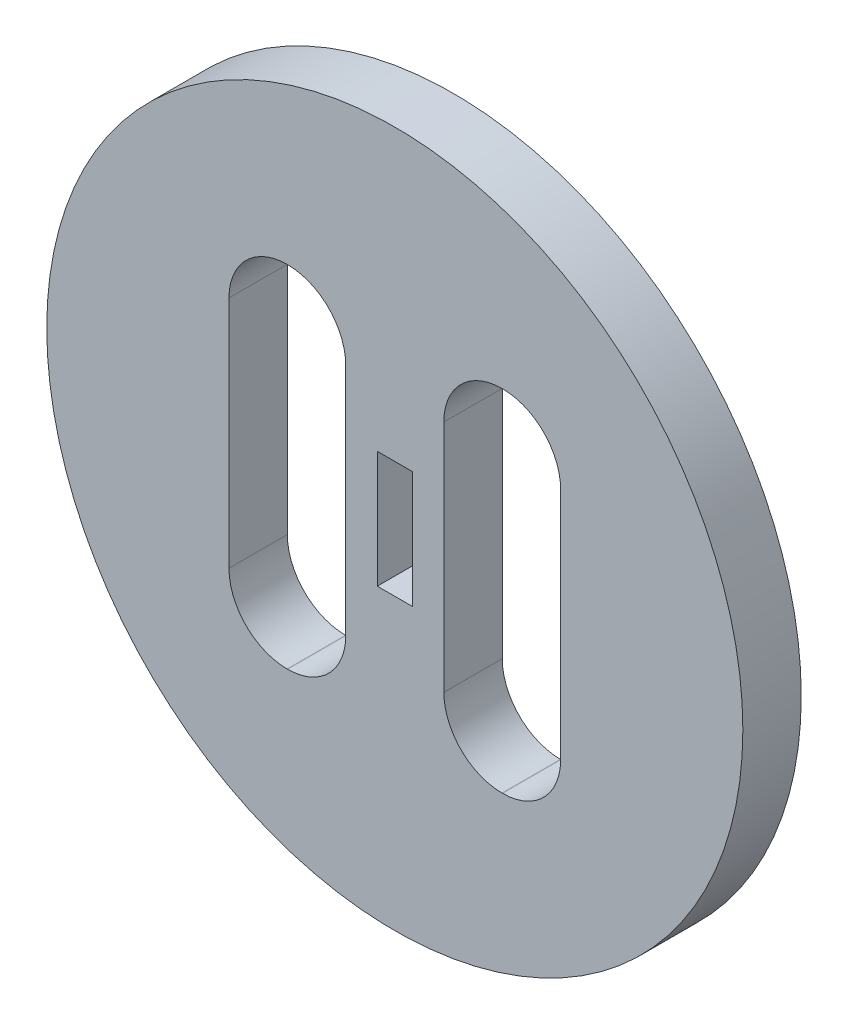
from build123d import *

# Parameters (mm, degrees)
SKETCH1_R          = 37.846
EXTRUDE1_DEPTH     = 6.35
CUT_EXTRUDE1_DEPTH = 54.897698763
SKETCH3_W          = 3.81
SKETCH3_H          = 12.7
CUT_EXTRUDE2_DEPTH = 54.897698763


with BuildPart() as part:
    # Sketch1 → Extrude1 (new body)
    with BuildSketch(Plane.XY):
        Circle(SKETCH1_R)
    extrude(amount=EXTRUDE1_DEPTH)

    # Sketch2 → Cut-Extrude1 (cut, through all)
    with BuildSketch(Plane.XY):
        with BuildLine():
            Line((-11.7094, 19.05), (-11.6586, 19.05))
            ThreePointArc((-11.6586, 19.05), (-7.186432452, 17.197567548), (-5.334, 12.7254))
            Line((-5.334, 12.7254), (-5.334, -12.7254))
            ThreePointArc((-5.334, -12.7254), (-7.186432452, -17.197567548), (-11.6586, -19.05))
            Line((-11.6586, -19.05), (-11.7094, -19.05))
            ThreePointArc((-11.7094, -19.05), (-16.181567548, -17.197567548), (-18.034, -12.7254))
            Line((-18.034, -12.7254), (-18.034, 12.7254))
            ThreePointArc((-18.034, 12.7254), (-16.181567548, 17.197567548), (-11.7094, 19.05))
        make_face()
        with BuildLine():
            Line((11.6586, 19.05), (11.7094, 19.05))
            ThreePointArc((11.7094, 19.05), (16.181567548, 17.197567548), (18.034, 12.7254))
            Line((18.034, 12.7254), (18.034, -12.7254))
            ThreePointArc((18.034, -12.7254), (16.181567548, -17.197567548), (11.7094, -19.05))
            Line((11.7094, -19.05), (11.6586, -19.05))
            ThreePointArc((11.6586, -19.05), (7.186432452, -17.197567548), (5.334, -12.7254))
            Line((5.334, -12.7254), (5.334, 12.7254))
            ThreePointArc((5.334, 12.7254), (7.186432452, 17.197567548), (11.6586, 19.05))
        make_face()
    extrude(amount=CUT_EXTRUDE1_DEPTH, mode=Mode.SUBTRACT)

    # Sketch3 → Cut-Extrude2 (cut, through all)
    with BuildSketch(Plane.XY):
        Rectangle(SKETCH3_W, SKETCH3_H)
    extrude(amount=CUT_EXTRUDE2_DEPTH, mode=Mode.SUBTRACT)


solid = part.part
